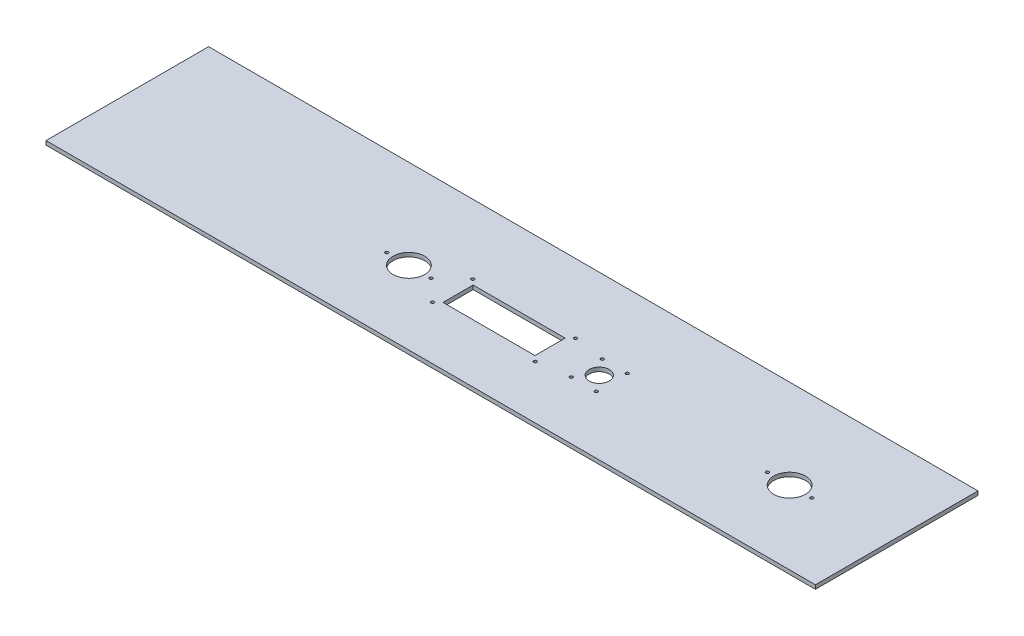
from build123d import *

# Parameters (mm, degrees)
SKETCH1_W           = 615.95
SKETCH1_H           = 130.175
BOSS_EXTRUDE1_DEPTH = 3.175
SKETCH2_R           = 1.25
SKETCH2_R_2         = 12.7
SKETCH2_R_3         = 8
SKETCH2_W           = 73.66
SKETCH2_H           = 24.13
CUT_EXTRUDE1_DEPTH  = 315.793684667


with BuildPart() as part:
    # Sketch1 → Boss-Extrude1 (new body)
    with BuildSketch(Plane(origin=(0, 0, 0), x_dir=(1, 0, 0), z_dir=(0, 1, 0))):
        Rectangle(SKETCH1_W, SKETCH1_H)
    extrude(amount=BOSS_EXTRUDE1_DEPTH)

    # Sketch2 → Cut-Extrude1 (cut, through all)
    with BuildSketch(Plane(origin=(0, 3.175, 0), x_dir=(1, 0, 0), z_dir=(0, 1, 0))):
        with Locations(Location((41.099999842, 9.699999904, 0), (0, 0, 270))):
            Circle(SKETCH2_R)
        with Locations(Location((41.099999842, -22.399999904, 0), (0, 0, 90))):
            Circle(SKETCH2_R)
        with Locations(Location((-41.099999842, -22.399999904, 0), (0, 0, 270))):
            Circle(SKETCH2_R)
        with Locations(Location((-41.099999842, 9.699999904, 0), (0, 0, 90))):
            Circle(SKETCH2_R)
        with Locations(Location((-76.2, -6.35, 0), (0, 0, 270))):
            Circle(SKETCH2_R_2)
        with Locations(Location((-93.98, -6.35, 0), (0, 0, 270))):
            Circle(SKETCH2_R)
        with Locations(Location((-58.42, -6.35, 0), (0, 0, 270))):
            Circle(SKETCH2_R)
        with Locations(Location((86.2, 6.15, 0), (0, 0, 270))):
            Circle(SKETCH2_R)
        with Locations(Location((86.2, -18.85, 0), (0, 0, 270))):
            Circle(SKETCH2_R)
        with Locations(Location((66.2, -18.85, 0), (0, 0, 270))):
            Circle(SKETCH2_R)
        with Locations(Location((66.2, 6.15, 0), (0, 0, 270))):
            Circle(SKETCH2_R)
        with Locations(Location((76.2, -6.35, 0), (0, 0, 270))):
            Circle(SKETCH2_R_3)
        with Locations(Location((246.38, -6.35, 0), (0, 0, 90))):
            Circle(SKETCH2_R)
        with Locations(Location((210.82, -6.35, 0), (0, 0, 90))):
            Circle(SKETCH2_R)
        with Locations(Location((228.6, -6.35, 0), (0, 0, 90))):
            Circle(SKETCH2_R_2)
        with Locations((0, -6.35)):
            Rectangle(SKETCH2_W, SKETCH2_H)
    extrude(amount=-CUT_EXTRUDE1_DEPTH, mode=Mode.SUBTRACT)


solid = part.part
